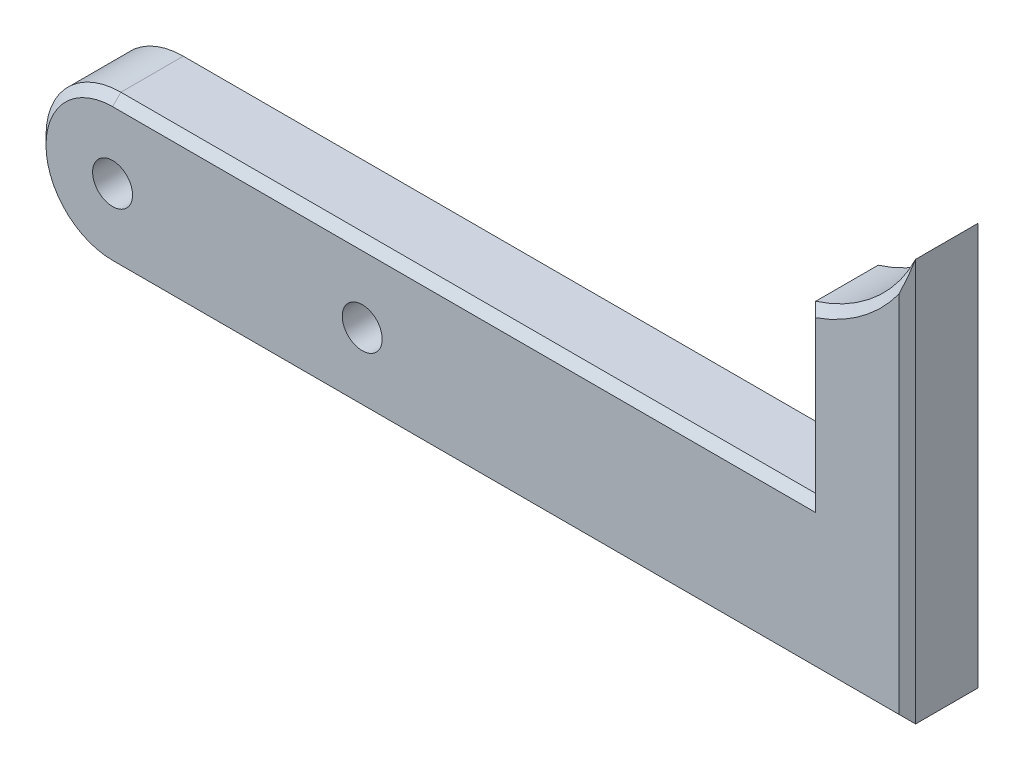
ISO-10303-21;
HEADER;
FILE_DESCRIPTION(('STEP AP214'),'2;1');
FILE_NAME('part.step','',(''),(''),'','','');
FILE_SCHEMA(('AUTOMOTIVE_DESIGN { 1 0 10303 214 1 1 1 1 }'));
ENDSEC;
DATA;
#1=APPLICATION_CONTEXT('core data for automotive mechanical design processes');
#2=APPLICATION_PROTOCOL_DEFINITION('international standard','automotive_design',2000,#1);
#3=PRODUCT_CONTEXT('',#1,'mechanical');
#4=PRODUCT('Part','Part','',(#3));
#5=PRODUCT_RELATED_PRODUCT_CATEGORY('part','',(#4));
#6=PRODUCT_DEFINITION_FORMATION('','',#4);
#7=PRODUCT_DEFINITION_CONTEXT('part definition',#1,'design');
#8=PRODUCT_DEFINITION('design','',#6,#7);
#9=PRODUCT_DEFINITION_SHAPE('','',#8);
#10=(LENGTH_UNIT() NAMED_UNIT(*) SI_UNIT(.MILLI.,.METRE.));
#11=(NAMED_UNIT(*) PLANE_ANGLE_UNIT() SI_UNIT($,.RADIAN.));
#12=(NAMED_UNIT(*) SI_UNIT($,.STERADIAN.) SOLID_ANGLE_UNIT());
#13=UNCERTAINTY_MEASURE_WITH_UNIT(LENGTH_MEASURE(1.E-05),#10,'distance_accuracy_value','');
#14=(GEOMETRIC_REPRESENTATION_CONTEXT(3) GLOBAL_UNCERTAINTY_ASSIGNED_CONTEXT((#13)) GLOBAL_UNIT_ASSIGNED_CONTEXT((#10,
#11,#12)) REPRESENTATION_CONTEXT('',''));
#15=CARTESIAN_POINT('',(0.,0.,0.));
#16=DIRECTION('',(0.,0.,1.));
#17=DIRECTION('',(1.,0.,0.));
#18=AXIS2_PLACEMENT_3D('',#15,#16,#17);
#19=CARTESIAN_POINT('',(96.5,67.0787840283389,4.75));
#20=DIRECTION('',(0.,0.,1.));
#21=DIRECTION('',(1.,0.,0.));
#22=AXIS2_PLACEMENT_3D('',#19,#20,#21);
#23=PLANE('',#22);
#24=CARTESIAN_POINT('',(19.,19.,4.75));
#25=DIRECTION('',(0.,0.,1.));
#26=DIRECTION('',(1.,0.,0.));
#27=AXIS2_PLACEMENT_3D('',#24,#25,#26);
#28=CIRCLE('',#27,8.00000000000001);
#29=CARTESIAN_POINT('',(11.,19.,4.75));
#30=VERTEX_POINT('',#29);
#31=CARTESIAN_POINT('',(19.,11.,4.75));
#32=VERTEX_POINT('',#31);
#33=EDGE_CURVE('E47',#30,#32,#28,.T.);
#34=ORIENTED_EDGE('',*,*,#33,.T.);
#35=DIRECTION('',(1.,0.,0.));
#36=VECTOR('',#35,1.);
#37=CARTESIAN_POINT('',(114.5,11.,4.75));
#38=LINE('',#37,#36);
#39=CARTESIAN_POINT('',(113.5,11.,4.75));
#40=VERTEX_POINT('',#39);
#41=EDGE_CURVE('E11',#32,#40,#38,.T.);
#42=ORIENTED_EDGE('',*,*,#41,.T.);
#43=DIRECTION('',(0.,1.,0.));
#44=VECTOR('',#43,1.);
#45=CARTESIAN_POINT('',(113.5,58.3609861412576,4.75));
#46=LINE('',#45,#44);
#47=CARTESIAN_POINT('',(113.5,54.749956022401,4.75));
#48=VERTEX_POINT('',#47);
#49=EDGE_CURVE('E227',#40,#48,#46,.T.);
#50=ORIENTED_EDGE('',*,*,#49,.T.);
#51=CARTESIAN_POINT('',(96.5,67.0787840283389,4.75));
#52=DIRECTION('',(0.,0.,1.));
#53=DIRECTION('',(1.,0.,0.));
#54=AXIS2_PLACEMENT_3D('',#51,#52,#53);
#55=CIRCLE('',#54,21.);
#56=CARTESIAN_POINT('',(103.5,47.2797941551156,4.75));
#57=VERTEX_POINT('',#56);
#58=EDGE_CURVE('E225',#48,#57,#55,.F.);
#59=ORIENTED_EDGE('',*,*,#58,.T.);
#60=DIRECTION('',(0.,-1.,0.));
#61=VECTOR('',#60,1.);
#62=CARTESIAN_POINT('',(103.5,28.,4.75));
#63=LINE('',#62,#61);
#64=CARTESIAN_POINT('',(103.5,27.,4.75));
#65=VERTEX_POINT('',#64);
#66=EDGE_CURVE('E223',#57,#65,#63,.T.);
#67=ORIENTED_EDGE('',*,*,#66,.T.);
#68=DIRECTION('',(-1.,0.,0.));
#69=VECTOR('',#68,1.);
#70=CARTESIAN_POINT('',(19.,27.,4.75));
#71=LINE('',#70,#69);
#72=CARTESIAN_POINT('',(19.,27.,4.75));
#73=VERTEX_POINT('',#72);
#74=EDGE_CURVE('E221',#65,#73,#71,.T.);
#75=ORIENTED_EDGE('',*,*,#74,.T.);
#76=CARTESIAN_POINT('',(19.,19.,4.75));
#77=DIRECTION('',(0.,0.,1.));
#78=DIRECTION('',(1.,0.,0.));
#79=AXIS2_PLACEMENT_3D('',#76,#77,#78);
#80=CIRCLE('',#79,8.00000000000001);
#81=EDGE_CURVE('E58',#73,#30,#80,.T.);
#82=ORIENTED_EDGE('',*,*,#81,.T.);
#83=EDGE_LOOP('',(#34,#42,#50,#59,#67,#75,#82));
#84=FACE_BOUND('',#83,.T.);
#85=CARTESIAN_POINT('',(19.,19.,4.75));
#86=DIRECTION('',(0.,0.,1.));
#87=DIRECTION('',(1.,0.,0.));
#88=AXIS2_PLACEMENT_3D('',#85,#86,#87);
#89=CIRCLE('',#88,2.4);
#90=CARTESIAN_POINT('',(21.4,19.,4.75));
#91=VERTEX_POINT('',#90);
#92=EDGE_CURVE('E366',#91,#91,#89,.T.);
#93=ORIENTED_EDGE('',*,*,#92,.F.);
#94=EDGE_LOOP('',(#93));
#95=FACE_BOUND('',#94,.T.);
#96=CARTESIAN_POINT('',(49.,19.,4.75));
#97=DIRECTION('',(0.,0.,1.));
#98=DIRECTION('',(1.,0.,0.));
#99=AXIS2_PLACEMENT_3D('',#96,#97,#98);
#100=CIRCLE('',#99,2.4);
#101=CARTESIAN_POINT('',(51.4,19.,4.75));
#102=VERTEX_POINT('',#101);
#103=EDGE_CURVE('E370',#102,#102,#100,.T.);
#104=ORIENTED_EDGE('',*,*,#103,.F.);
#105=EDGE_LOOP('',(#104));
#106=FACE_BOUND('',#105,.T.);
#107=ADVANCED_FACE('F37',(#84,#95,#106),#23,.T.);
#108=CARTESIAN_POINT('',(96.5,67.0787840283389,-4.75));
#109=DIRECTION('',(0.,0.,1.));
#110=DIRECTION('',(1.,0.,0.));
#111=AXIS2_PLACEMENT_3D('',#108,#109,#110);
#112=PLANE('',#111);
#113=DIRECTION('',(0.,-1.,0.));
#114=VECTOR('',#113,1.);
#115=CARTESIAN_POINT('',(113.5,67.0787840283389,-4.75));
#116=LINE('',#115,#114);
#117=CARTESIAN_POINT('',(113.5,54.749956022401,-4.75));
#118=VERTEX_POINT('',#117);
#119=CARTESIAN_POINT('',(113.5,11.,-4.75));
#120=VERTEX_POINT('',#119);
#121=EDGE_CURVE('E192',#118,#120,#116,.T.);
#122=ORIENTED_EDGE('',*,*,#121,.T.);
#123=DIRECTION('',(-1.,0.,0.));
#124=VECTOR('',#123,1.);
#125=CARTESIAN_POINT('',(96.5,11.,-4.75));
#126=LINE('',#125,#124);
#127=CARTESIAN_POINT('',(19.,11.,-4.75));
#128=VERTEX_POINT('',#127);
#129=EDGE_CURVE('E158',#120,#128,#126,.T.);
#130=ORIENTED_EDGE('',*,*,#129,.T.);
#131=CARTESIAN_POINT('',(19.,19.,-4.75));
#132=DIRECTION('',(0.,0.,1.));
#133=DIRECTION('',(1.,0.,0.));
#134=AXIS2_PLACEMENT_3D('',#131,#132,#133);
#135=CIRCLE('',#134,8.);
#136=CARTESIAN_POINT('',(11.,19.,-4.75));
#137=VERTEX_POINT('',#136);
#138=EDGE_CURVE('E196',#128,#137,#135,.F.);
#139=ORIENTED_EDGE('',*,*,#138,.T.);
#140=CARTESIAN_POINT('',(19.,19.,-4.75));
#141=DIRECTION('',(0.,0.,1.));
#142=DIRECTION('',(1.,0.,0.));
#143=AXIS2_PLACEMENT_3D('',#140,#141,#142);
#144=CIRCLE('',#143,8.);
#145=CARTESIAN_POINT('',(19.,27.,-4.75));
#146=VERTEX_POINT('',#145);
#147=EDGE_CURVE('E194',#137,#146,#144,.F.);
#148=ORIENTED_EDGE('',*,*,#147,.T.);
#149=DIRECTION('',(1.,0.,0.));
#150=VECTOR('',#149,1.);
#151=CARTESIAN_POINT('',(96.5,27.,-4.75));
#152=LINE('',#151,#150);
#153=CARTESIAN_POINT('',(103.5,27.,-4.75));
#154=VERTEX_POINT('',#153);
#155=EDGE_CURVE('E186',#146,#154,#152,.T.);
#156=ORIENTED_EDGE('',*,*,#155,.T.);
#157=DIRECTION('',(0.,1.,0.));
#158=VECTOR('',#157,1.);
#159=CARTESIAN_POINT('',(103.5,67.0787840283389,-4.75));
#160=LINE('',#159,#158);
#161=CARTESIAN_POINT('',(103.5,47.2797941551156,-4.75));
#162=VERTEX_POINT('',#161);
#163=EDGE_CURVE('E188',#154,#162,#160,.T.);
#164=ORIENTED_EDGE('',*,*,#163,.T.);
#165=CARTESIAN_POINT('',(96.5,67.0787840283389,-4.75));
#166=DIRECTION('',(0.,0.,1.));
#167=DIRECTION('',(1.,0.,0.));
#168=AXIS2_PLACEMENT_3D('',#165,#166,#167);
#169=CIRCLE('',#168,21.);
#170=EDGE_CURVE('E190',#162,#118,#169,.T.);
#171=ORIENTED_EDGE('',*,*,#170,.T.);
#172=EDGE_LOOP('',(#122,#130,#139,#148,#156,#164,#171));
#173=FACE_BOUND('',#172,.T.);
#174=CARTESIAN_POINT('',(19.,19.,-4.75));
#175=DIRECTION('',(0.,0.,1.));
#176=DIRECTION('',(1.,0.,0.));
#177=AXIS2_PLACEMENT_3D('',#174,#175,#176);
#178=CIRCLE('',#177,2.4);
#179=CARTESIAN_POINT('',(21.4,19.,-4.75));
#180=VERTEX_POINT('',#179);
#181=EDGE_CURVE('E367',#180,#180,#178,.T.);
#182=ORIENTED_EDGE('',*,*,#181,.T.);
#183=EDGE_LOOP('',(#182));
#184=FACE_BOUND('',#183,.T.);
#185=CARTESIAN_POINT('',(49.,19.,-4.75));
#186=DIRECTION('',(0.,0.,1.));
#187=DIRECTION('',(1.,0.,0.));
#188=AXIS2_PLACEMENT_3D('',#185,#186,#187);
#189=CIRCLE('',#188,2.4);
#190=CARTESIAN_POINT('',(51.4,19.,-4.75));
#191=VERTEX_POINT('',#190);
#192=EDGE_CURVE('E182',#191,#191,#189,.T.);
#193=ORIENTED_EDGE('',*,*,#192,.T.);
#194=EDGE_LOOP('',(#193));
#195=FACE_BOUND('',#194,.T.);
#196=ADVANCED_FACE('F382',(#173,#184,#195),#112,.F.);
#197=CARTESIAN_POINT('',(10.,10.,4.75));
#198=DIRECTION('',(0.,1.,0.));
#199=DIRECTION('',(-1.,0.,0.));
#200=AXIS2_PLACEMENT_3D('',#197,#198,#199);
#201=PLANE('',#200);
#202=DIRECTION('',(0.,0.,-1.));
#203=VECTOR('',#202,1.);
#204=CARTESIAN_POINT('',(19.,10.,4.75));
#205=LINE('',#204,#203);
#206=CARTESIAN_POINT('',(19.,10.,3.75));
#207=VERTEX_POINT('',#206);
#208=CARTESIAN_POINT('',(19.,10.,-3.75));
#209=VERTEX_POINT('',#208);
#210=EDGE_CURVE('E165',#207,#209,#205,.T.);
#211=ORIENTED_EDGE('',*,*,#210,.T.);
#212=DIRECTION('',(1.,0.,0.));
#213=VECTOR('',#212,1.);
#214=CARTESIAN_POINT('',(10.,10.,-3.75));
#215=LINE('',#214,#213);
#216=CARTESIAN_POINT('',(114.5,10.,-3.75));
#217=VERTEX_POINT('',#216);
#218=EDGE_CURVE('E169',#209,#217,#215,.T.);
#219=ORIENTED_EDGE('',*,*,#218,.T.);
#220=DIRECTION('',(0.,0.,-1.));
#221=VECTOR('',#220,1.);
#222=CARTESIAN_POINT('',(114.5,10.,4.75));
#223=LINE('',#222,#221);
#224=CARTESIAN_POINT('',(114.5,10.,3.75));
#225=VERTEX_POINT('',#224);
#226=EDGE_CURVE('E168',#225,#217,#223,.T.);
#227=ORIENTED_EDGE('',*,*,#226,.F.);
#228=DIRECTION('',(-1.,0.,0.));
#229=VECTOR('',#228,1.);
#230=CARTESIAN_POINT('',(19.,10.,3.75));
#231=LINE('',#230,#229);
#232=EDGE_CURVE('E143',#225,#207,#231,.T.);
#233=ORIENTED_EDGE('',*,*,#232,.T.);
#234=EDGE_LOOP('',(#211,#219,#227,#233));
#235=FACE_BOUND('',#234,.T.);
#236=ADVANCED_FACE('F163',(#235),#201,.F.);
#237=CARTESIAN_POINT('',(114.5,58.3609861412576,4.75));
#238=DIRECTION('',(-1.,0.,0.));
#239=DIRECTION('',(0.,0.,1.));
#240=AXIS2_PLACEMENT_3D('',#237,#238,#239);
#241=PLANE('',#240);
#242=ORIENTED_EDGE('',*,*,#226,.T.);
#243=DIRECTION('',(0.,1.,0.));
#244=VECTOR('',#243,1.);
#245=CARTESIAN_POINT('',(114.5,58.3609861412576,-3.75));
#246=LINE('',#245,#244);
#247=CARTESIAN_POINT('',(114.5,58.3609861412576,-3.75));
#248=VERTEX_POINT('',#247);
#249=EDGE_CURVE('E207',#217,#248,#246,.T.);
#250=ORIENTED_EDGE('',*,*,#249,.T.);
#251=DIRECTION('',(0.,0.,-1.));
#252=VECTOR('',#251,1.);
#253=CARTESIAN_POINT('',(114.5,58.3609861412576,4.75));
#254=LINE('',#253,#252);
#255=CARTESIAN_POINT('',(114.5,58.3609861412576,3.75));
#256=VERTEX_POINT('',#255);
#257=EDGE_CURVE('E177',#256,#248,#254,.T.);
#258=ORIENTED_EDGE('',*,*,#257,.F.);
#259=DIRECTION('',(0.,-1.,0.));
#260=VECTOR('',#259,1.);
#261=CARTESIAN_POINT('',(114.5,10.,3.75));
#262=LINE('',#261,#260);
#263=EDGE_CURVE('E205',#256,#225,#262,.T.);
#264=ORIENTED_EDGE('',*,*,#263,.T.);
#265=EDGE_LOOP('',(#242,#250,#258,#264));
#266=FACE_BOUND('',#265,.T.);
#267=ADVANCED_FACE('F354',(#266),#241,.F.);
#268=CARTESIAN_POINT('',(96.5,67.0787840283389,4.75));
#269=DIRECTION('',(0.,0.,-1.));
#270=DIRECTION('',(-1.,0.,0.));
#271=AXIS2_PLACEMENT_3D('',#268,#269,#270);
#272=CYLINDRICAL_SURFACE('',#271,20.);
#273=ORIENTED_EDGE('',*,*,#257,.T.);
#274=CARTESIAN_POINT('',(96.5,67.0787840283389,-3.75));
#275=DIRECTION('',(0.,0.,1.));
#276=DIRECTION('',(1.,0.,0.));
#277=AXIS2_PLACEMENT_3D('',#274,#275,#276);
#278=CIRCLE('',#277,20.);
#279=CARTESIAN_POINT('',(102.5,48.,-3.75));
#280=VERTEX_POINT('',#279);
#281=EDGE_CURVE('E211',#248,#280,#278,.F.);
#282=ORIENTED_EDGE('',*,*,#281,.T.);
#283=DIRECTION('',(0.,0.,-1.));
#284=VECTOR('',#283,1.);
#285=CARTESIAN_POINT('',(102.5,48.,4.75));
#286=LINE('',#285,#284);
#287=CARTESIAN_POINT('',(102.5,48.,3.75));
#288=VERTEX_POINT('',#287);
#289=EDGE_CURVE('E359',#288,#280,#286,.T.);
#290=ORIENTED_EDGE('',*,*,#289,.F.);
#291=CARTESIAN_POINT('',(96.5,67.0787840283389,3.75));
#292=DIRECTION('',(0.,0.,1.));
#293=DIRECTION('',(1.,0.,0.));
#294=AXIS2_PLACEMENT_3D('',#291,#292,#293);
#295=CIRCLE('',#294,20.);
#296=EDGE_CURVE('E209',#288,#256,#295,.T.);
#297=ORIENTED_EDGE('',*,*,#296,.T.);
#298=EDGE_LOOP('',(#273,#282,#290,#297));
#299=FACE_BOUND('',#298,.T.);
#300=ADVANCED_FACE('F400',(#299),#272,.F.);
#301=CARTESIAN_POINT('',(102.5,48.,4.75));
#302=DIRECTION('',(1.,0.,0.));
#303=DIRECTION('',(0.,0.,-1.));
#304=AXIS2_PLACEMENT_3D('',#301,#302,#303);
#305=PLANE('',#304);
#306=ORIENTED_EDGE('',*,*,#289,.T.);
#307=DIRECTION('',(0.,-1.,0.));
#308=VECTOR('',#307,1.);
#309=CARTESIAN_POINT('',(102.5,48.,-3.75));
#310=LINE('',#309,#308);
#311=CARTESIAN_POINT('',(102.5,28.,-3.75));
#312=VERTEX_POINT('',#311);
#313=EDGE_CURVE('E215',#280,#312,#310,.T.);
#314=ORIENTED_EDGE('',*,*,#313,.T.);
#315=DIRECTION('',(0.,0.,-1.));
#316=VECTOR('',#315,1.);
#317=CARTESIAN_POINT('',(102.5,28.,4.75));
#318=LINE('',#317,#316);
#319=CARTESIAN_POINT('',(102.5,28.,3.75));
#320=VERTEX_POINT('',#319);
#321=EDGE_CURVE('E361',#320,#312,#318,.T.);
#322=ORIENTED_EDGE('',*,*,#321,.F.);
#323=DIRECTION('',(0.,1.,0.));
#324=VECTOR('',#323,1.);
#325=CARTESIAN_POINT('',(102.5,48.,3.75));
#326=LINE('',#325,#324);
#327=EDGE_CURVE('E213',#320,#288,#326,.T.);
#328=ORIENTED_EDGE('',*,*,#327,.T.);
#329=EDGE_LOOP('',(#306,#314,#322,#328));
#330=FACE_BOUND('',#329,.T.);
#331=ADVANCED_FACE('F396',(#330),#305,.F.);
#332=CARTESIAN_POINT('',(10.,28.,4.75));
#333=DIRECTION('',(0.,-1.,0.));
#334=DIRECTION('',(1.,0.,0.));
#335=AXIS2_PLACEMENT_3D('',#332,#333,#334);
#336=PLANE('',#335);
#337=ORIENTED_EDGE('',*,*,#321,.T.);
#338=DIRECTION('',(-1.,0.,0.));
#339=VECTOR('',#338,1.);
#340=CARTESIAN_POINT('',(10.,28.,-3.75));
#341=LINE('',#340,#339);
#342=CARTESIAN_POINT('',(19.,28.,-3.75));
#343=VERTEX_POINT('',#342);
#344=EDGE_CURVE('E219',#312,#343,#341,.T.);
#345=ORIENTED_EDGE('',*,*,#344,.T.);
#346=DIRECTION('',(0.,0.,-1.));
#347=VECTOR('',#346,1.);
#348=CARTESIAN_POINT('',(19.,28.,4.75));
#349=LINE('',#348,#347);
#350=CARTESIAN_POINT('',(19.,28.,3.75));
#351=VERTEX_POINT('',#350);
#352=EDGE_CURVE('E170',#343,#351,#349,.F.);
#353=ORIENTED_EDGE('',*,*,#352,.T.);
#354=DIRECTION('',(1.,0.,0.));
#355=VECTOR('',#354,1.);
#356=CARTESIAN_POINT('',(102.5,28.,3.75));
#357=LINE('',#356,#355);
#358=EDGE_CURVE('E217',#351,#320,#357,.T.);
#359=ORIENTED_EDGE('',*,*,#358,.T.);
#360=EDGE_LOOP('',(#337,#345,#353,#359));
#361=FACE_BOUND('',#360,.T.);
#362=ADVANCED_FACE('F393',(#361),#336,.F.);
#363=CARTESIAN_POINT('',(19.,19.,4.75));
#364=DIRECTION('',(0.,0.,-1.));
#365=DIRECTION('',(-1.,0.,0.));
#366=AXIS2_PLACEMENT_3D('',#363,#364,#365);
#367=CYLINDRICAL_SURFACE('',#366,2.4);
#368=ORIENTED_EDGE('',*,*,#92,.T.);
#369=EDGE_LOOP('',(#368));
#370=FACE_BOUND('',#369,.T.);
#371=ORIENTED_EDGE('',*,*,#181,.F.);
#372=EDGE_LOOP('',(#371));
#373=FACE_BOUND('',#372,.T.);
#374=ADVANCED_FACE('F390',(#370,#373),#367,.F.);
#375=CARTESIAN_POINT('',(49.,19.,4.75));
#376=DIRECTION('',(0.,0.,-1.));
#377=DIRECTION('',(-1.,0.,0.));
#378=AXIS2_PLACEMENT_3D('',#375,#376,#377);
#379=CYLINDRICAL_SURFACE('',#378,2.4);
#380=ORIENTED_EDGE('',*,*,#103,.T.);
#381=EDGE_LOOP('',(#380));
#382=FACE_BOUND('',#381,.T.);
#383=ORIENTED_EDGE('',*,*,#192,.F.);
#384=EDGE_LOOP('',(#383));
#385=FACE_BOUND('',#384,.T.);
#386=ADVANCED_FACE('F378',(#382,#385),#379,.F.);
#387=CARTESIAN_POINT('',(19.,19.,4.75));
#388=DIRECTION('',(0.,0.,-1.));
#389=DIRECTION('',(-1.,0.,0.));
#390=AXIS2_PLACEMENT_3D('',#387,#388,#389);
#391=CYLINDRICAL_SURFACE('',#390,9.);
#392=ORIENTED_EDGE('',*,*,#352,.F.);
#393=CARTESIAN_POINT('',(19.,19.,-3.75));
#394=DIRECTION('',(0.,0.,1.));
#395=DIRECTION('',(1.,0.,0.));
#396=AXIS2_PLACEMENT_3D('',#393,#394,#395);
#397=CIRCLE('',#396,9.);
#398=CARTESIAN_POINT('',(10.,19.,-3.75));
#399=VERTEX_POINT('',#398);
#400=EDGE_CURVE('E203',#343,#399,#397,.T.);
#401=ORIENTED_EDGE('',*,*,#400,.T.);
#402=DIRECTION('',(0.,0.,-1.));
#403=VECTOR('',#402,1.);
#404=CARTESIAN_POINT('',(10.,19.,4.75));
#405=LINE('',#404,#403);
#406=CARTESIAN_POINT('',(10.,19.,3.75));
#407=VERTEX_POINT('',#406);
#408=EDGE_CURVE('E181',#407,#399,#405,.T.);
#409=ORIENTED_EDGE('',*,*,#408,.F.);
#410=CARTESIAN_POINT('',(19.,19.,3.75));
#411=DIRECTION('',(0.,0.,1.));
#412=DIRECTION('',(1.,0.,0.));
#413=AXIS2_PLACEMENT_3D('',#410,#411,#412);
#414=CIRCLE('',#413,9.);
#415=EDGE_CURVE('E201',#407,#351,#414,.F.);
#416=ORIENTED_EDGE('',*,*,#415,.T.);
#417=EDGE_LOOP('',(#392,#401,#409,#416));
#418=FACE_BOUND('',#417,.T.);
#419=ADVANCED_FACE('F410',(#418),#391,.T.);
#420=CARTESIAN_POINT('',(19.,19.,4.75));
#421=DIRECTION('',(0.,0.,-1.));
#422=DIRECTION('',(-1.,0.,0.));
#423=AXIS2_PLACEMENT_3D('',#420,#421,#422);
#424=CYLINDRICAL_SURFACE('',#423,9.);
#425=ORIENTED_EDGE('',*,*,#408,.T.);
#426=CARTESIAN_POINT('',(19.,19.,-3.75));
#427=DIRECTION('',(0.,0.,1.));
#428=DIRECTION('',(1.,0.,0.));
#429=AXIS2_PLACEMENT_3D('',#426,#427,#428);
#430=CIRCLE('',#429,9.);
#431=EDGE_CURVE('E157',#399,#209,#430,.T.);
#432=ORIENTED_EDGE('',*,*,#431,.T.);
#433=ORIENTED_EDGE('',*,*,#210,.F.);
#434=CARTESIAN_POINT('',(19.,19.,3.75));
#435=DIRECTION('',(0.,0.,1.));
#436=DIRECTION('',(1.,0.,0.));
#437=AXIS2_PLACEMENT_3D('',#434,#435,#436);
#438=CIRCLE('',#437,9.);
#439=EDGE_CURVE('E150',#207,#407,#438,.F.);
#440=ORIENTED_EDGE('',*,*,#439,.T.);
#441=EDGE_LOOP('',(#425,#432,#433,#440));
#442=FACE_BOUND('',#441,.T.);
#443=ADVANCED_FACE('F172',(#442),#424,.T.);
#444=CARTESIAN_POINT('',(10.,28.,-3.75));
#445=DIRECTION('',(0.,-0.707106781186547,0.707106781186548));
#446=DIRECTION('',(-1.,0.,0.));
#447=AXIS2_PLACEMENT_3D('',#444,#445,#446);
#448=PLANE('',#447);
#449=DIRECTION('',(0.,-0.707106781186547,-0.707106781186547));
#450=VECTOR('',#449,1.);
#451=CARTESIAN_POINT('',(19.,28.,-3.75));
#452=LINE('',#451,#450);
#453=EDGE_CURVE('E285',#343,#146,#452,.T.);
#454=ORIENTED_EDGE('',*,*,#453,.F.);
#455=ORIENTED_EDGE('',*,*,#344,.F.);
#456=DIRECTION('',(0.577350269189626,-0.577350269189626,-0.577350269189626));
#457=VECTOR('',#456,1.);
#458=CARTESIAN_POINT('',(95.8333333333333,34.6666666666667,2.91666666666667));
#459=LINE('',#458,#457);
#460=EDGE_CURVE('E183',#154,#312,#459,.F.);
#461=ORIENTED_EDGE('',*,*,#460,.F.);
#462=ORIENTED_EDGE('',*,*,#155,.F.);
#463=EDGE_LOOP('',(#454,#455,#461,#462));
#464=FACE_BOUND('',#463,.T.);
#465=ADVANCED_FACE('F275',(#464),#448,.F.);
#466=CARTESIAN_POINT('',(102.5,48.,-3.75));
#467=DIRECTION('',(0.707106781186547,0.,0.707106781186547));
#468=DIRECTION('',(0.,-1.,0.));
#469=AXIS2_PLACEMENT_3D('',#466,#467,#468);
#470=PLANE('',#469);
#471=ORIENTED_EDGE('',*,*,#460,.T.);
#472=ORIENTED_EDGE('',*,*,#313,.F.);
#473=CARTESIAN_POINT('',(102.5,48.,-3.75));
#474=CARTESIAN_POINT('',(102.666030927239,47.8782000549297,-3.91603092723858));
#475=CARTESIAN_POINT('',(102.832379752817,47.757282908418,-4.08237975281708));
#476=CARTESIAN_POINT('',(103.165713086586,47.5172142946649,-4.41571308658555));
#477=CARTESIAN_POINT('',(103.33269759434,47.3980628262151,-4.58269759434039));
#478=CARTESIAN_POINT('',(103.5,47.2797941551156,-4.74999999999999));
#479=B_SPLINE_CURVE_WITH_KNOTS('',3,(#473,#474,#475,#476,#477,#478),.UNSPECIFIED.,.F.,.F.,(4,2,
4),(0.,0.79352591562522,1.58705128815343),.UNSPECIFIED.);
#480=EDGE_CURVE('E278',#162,#280,#479,.F.);
#481=ORIENTED_EDGE('',*,*,#480,.F.);
#482=ORIENTED_EDGE('',*,*,#163,.F.);
#483=EDGE_LOOP('',(#471,#472,#481,#482));
#484=FACE_BOUND('',#483,.T.);
#485=ADVANCED_FACE('F267',(#484),#470,.F.);
#486=CARTESIAN_POINT('',(19.,19.,-4.75));
#487=DIRECTION('',(0.,0.,1.));
#488=DIRECTION('',(1.,0.,0.));
#489=AXIS2_PLACEMENT_3D('',#486,#487,#488);
#490=CONICAL_SURFACE('',#489,8.,0.785398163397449);
#491=ORIENTED_EDGE('',*,*,#453,.T.);
#492=ORIENTED_EDGE('',*,*,#147,.F.);
#493=DIRECTION('',(0.707106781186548,0.,-0.707106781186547));
#494=VECTOR('',#493,1.);
#495=CARTESIAN_POINT('',(10.,19.,-3.75));
#496=LINE('',#495,#494);
#497=EDGE_CURVE('E244',#399,#137,#496,.T.);
#498=ORIENTED_EDGE('',*,*,#497,.F.);
#499=ORIENTED_EDGE('',*,*,#400,.F.);
#500=EDGE_LOOP('',(#491,#492,#498,#499));
#501=FACE_BOUND('',#500,.T.);
#502=ADVANCED_FACE('F274',(#501),#490,.T.);
#503=CARTESIAN_POINT('',(96.5,67.0787840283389,-3.75));
#504=DIRECTION('',(0.,0.,-1.));
#505=DIRECTION('',(-1.,0.,0.));
#506=AXIS2_PLACEMENT_3D('',#503,#504,#505);
#507=CONICAL_SURFACE('',#506,20.,0.78539816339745);
#508=ORIENTED_EDGE('',*,*,#480,.T.);
#509=ORIENTED_EDGE('',*,*,#281,.F.);
#510=CARTESIAN_POINT('',(114.5,58.3609861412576,-3.75));
#511=CARTESIAN_POINT('',(114.429406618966,58.0532667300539,-3.8205933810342));
#512=CARTESIAN_POINT('',(114.355429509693,57.7471104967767,-3.89457049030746));
#513=CARTESIAN_POINT('',(114.201054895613,57.1383437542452,-4.04894510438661));
#514=CARTESIAN_POINT('',(114.120662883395,56.8357304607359,-4.12933711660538));
#515=CARTESIAN_POINT('',(113.953689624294,56.233963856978,-4.29631037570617));
#516=CARTESIAN_POINT('',(113.867108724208,55.9348103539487,-4.38289127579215));
#517=CARTESIAN_POINT('',(113.687961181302,55.3398082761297,-4.56203881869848));
#518=CARTESIAN_POINT('',(113.595389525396,55.0439627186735,-4.65461047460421));
#519=CARTESIAN_POINT('',(113.5,54.749956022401,-4.75));
#520=B_SPLINE_CURVE_WITH_KNOTS('',3,(#510,#511,#512,#513,#514,#515,#516,#517,#518,#519),
.UNSPECIFIED.,.F.,.F.,(4,2,2,2,4),(0.,0.970473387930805,1.94012457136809,2.90972146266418,
3.88014047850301),.UNSPECIFIED.);
#521=EDGE_CURVE('E235',#118,#248,#520,.F.);
#522=ORIENTED_EDGE('',*,*,#521,.F.);
#523=ORIENTED_EDGE('',*,*,#170,.F.);
#524=EDGE_LOOP('',(#508,#509,#522,#523));
#525=FACE_BOUND('',#524,.T.);
#526=ADVANCED_FACE('F247',(#525),#507,.F.);
#527=CARTESIAN_POINT('',(19.,19.,-4.75));
#528=DIRECTION('',(0.,0.,1.));
#529=DIRECTION('',(1.,0.,0.));
#530=AXIS2_PLACEMENT_3D('',#527,#528,#529);
#531=CONICAL_SURFACE('',#530,8.,0.785398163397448);
#532=ORIENTED_EDGE('',*,*,#497,.T.);
#533=ORIENTED_EDGE('',*,*,#138,.F.);
#534=DIRECTION('',(0.,0.707106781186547,-0.707106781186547));
#535=VECTOR('',#534,1.);
#536=CARTESIAN_POINT('',(19.,10.,-3.75));
#537=LINE('',#536,#535);
#538=EDGE_CURVE('E233',#209,#128,#537,.T.);
#539=ORIENTED_EDGE('',*,*,#538,.F.);
#540=ORIENTED_EDGE('',*,*,#431,.F.);
#541=EDGE_LOOP('',(#532,#533,#539,#540));
#542=FACE_BOUND('',#541,.T.);
#543=ADVANCED_FACE('F259',(#542),#531,.T.);
#544=CARTESIAN_POINT('',(114.5,58.3609861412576,-3.75));
#545=DIRECTION('',(-0.707106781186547,0.,0.707106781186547));
#546=DIRECTION('',(0.,1.,0.));
#547=AXIS2_PLACEMENT_3D('',#544,#545,#546);
#548=PLANE('',#547);
#549=ORIENTED_EDGE('',*,*,#521,.T.);
#550=ORIENTED_EDGE('',*,*,#249,.F.);
#551=DIRECTION('',(-0.577350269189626,0.577350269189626,-0.577350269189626));
#552=VECTOR('',#551,1.);
#553=CARTESIAN_POINT('',(98.3796712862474,26.1203287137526,-19.8703287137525));
#554=LINE('',#553,#552);
#555=EDGE_CURVE('E231',#120,#217,#554,.F.);
#556=ORIENTED_EDGE('',*,*,#555,.F.);
#557=ORIENTED_EDGE('',*,*,#121,.F.);
#558=EDGE_LOOP('',(#549,#550,#556,#557));
#559=FACE_BOUND('',#558,.T.);
#560=ADVANCED_FACE('F251',(#559),#548,.F.);
#561=CARTESIAN_POINT('',(10.,10.,-3.75));
#562=DIRECTION('',(0.,0.707106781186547,0.707106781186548));
#563=DIRECTION('',(1.,0.,0.));
#564=AXIS2_PLACEMENT_3D('',#561,#562,#563);
#565=PLANE('',#564);
#566=ORIENTED_EDGE('',*,*,#538,.T.);
#567=ORIENTED_EDGE('',*,*,#129,.F.);
#568=ORIENTED_EDGE('',*,*,#555,.T.);
#569=ORIENTED_EDGE('',*,*,#218,.F.);
#570=EDGE_LOOP('',(#566,#567,#568,#569));
#571=FACE_BOUND('',#570,.T.);
#572=ADVANCED_FACE('F258',(#571),#565,.F.);
#573=CARTESIAN_POINT('',(96.5,27.,4.75));
#574=DIRECTION('',(0.,0.707106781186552,0.707106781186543));
#575=DIRECTION('',(1.,0.,0.));
#576=AXIS2_PLACEMENT_3D('',#573,#574,#575);
#577=PLANE('',#576);
#578=DIRECTION('',(0.,0.707106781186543,-0.707106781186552));
#579=VECTOR('',#578,1.);
#580=CARTESIAN_POINT('',(19.,27.,4.75));
#581=LINE('',#580,#579);
#582=EDGE_CURVE('E332',#73,#351,#581,.T.);
#583=ORIENTED_EDGE('',*,*,#582,.F.);
#584=ORIENTED_EDGE('',*,*,#74,.F.);
#585=DIRECTION('',(-0.577350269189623,0.577350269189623,-0.577350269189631));
#586=VECTOR('',#585,1.);
#587=CARTESIAN_POINT('',(90.1404053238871,40.3595946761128,-8.60959467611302));
#588=LINE('',#587,#586);
#589=EDGE_CURVE('E42',#320,#65,#588,.F.);
#590=ORIENTED_EDGE('',*,*,#589,.F.);
#591=ORIENTED_EDGE('',*,*,#358,.F.);
#592=EDGE_LOOP('',(#583,#584,#590,#591));
#593=FACE_BOUND('',#592,.T.);
#594=ADVANCED_FACE('F40',(#593),#577,.T.);
#595=CARTESIAN_POINT('',(103.5,67.0787840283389,4.75));
#596=DIRECTION('',(-0.707106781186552,0.,0.707106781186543));
#597=DIRECTION('',(0.,1.,0.));
#598=AXIS2_PLACEMENT_3D('',#595,#596,#597);
#599=PLANE('',#598);
#600=ORIENTED_EDGE('',*,*,#589,.T.);
#601=ORIENTED_EDGE('',*,*,#66,.F.);
#602=CARTESIAN_POINT('',(103.5,47.2797941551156,4.75));
#603=CARTESIAN_POINT('',(103.33269759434,47.3980628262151,4.58269759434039));
#604=CARTESIAN_POINT('',(103.165713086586,47.517214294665,4.41571308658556));
#605=CARTESIAN_POINT('',(102.832379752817,47.757282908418,4.08237975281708));
#606=CARTESIAN_POINT('',(102.666030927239,47.8782000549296,3.91603092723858));
#607=CARTESIAN_POINT('',(102.5,48.,3.75));
#608=B_SPLINE_CURVE_WITH_KNOTS('',3,(#602,#603,#604,#605,#606,#607),.UNSPECIFIED.,.F.,.F.,(4,2,
4),(0.,0.793525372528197,1.58705128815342),.UNSPECIFIED.);
#609=EDGE_CURVE('E326',#288,#57,#608,.F.);
#610=ORIENTED_EDGE('',*,*,#609,.F.);
#611=ORIENTED_EDGE('',*,*,#327,.F.);
#612=EDGE_LOOP('',(#600,#601,#610,#611));
#613=FACE_BOUND('',#612,.T.);
#614=ADVANCED_FACE('F318',(#613),#599,.T.);
#615=CARTESIAN_POINT('',(19.,19.,4.75));
#616=DIRECTION('',(0.,0.,-1.));
#617=DIRECTION('',(-1.,0.,0.));
#618=AXIS2_PLACEMENT_3D('',#615,#616,#617);
#619=CONICAL_SURFACE('',#618,8.00000000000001,0.785398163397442);
#620=ORIENTED_EDGE('',*,*,#582,.T.);
#621=ORIENTED_EDGE('',*,*,#415,.F.);
#622=DIRECTION('',(-0.707106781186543,0.,-0.707106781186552));
#623=VECTOR('',#622,1.);
#624=CARTESIAN_POINT('',(11.,19.,4.75));
#625=LINE('',#624,#623);
#626=EDGE_CURVE('E152',#30,#407,#625,.T.);
#627=ORIENTED_EDGE('',*,*,#626,.F.);
#628=ORIENTED_EDGE('',*,*,#81,.F.);
#629=EDGE_LOOP('',(#620,#621,#627,#628));
#630=FACE_BOUND('',#629,.T.);
#631=ADVANCED_FACE('F324',(#630),#619,.T.);
#632=CARTESIAN_POINT('',(96.5,67.0787840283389,4.75));
#633=DIRECTION('',(0.,0.,1.));
#634=DIRECTION('',(1.,0.,0.));
#635=AXIS2_PLACEMENT_3D('',#632,#633,#634);
#636=CONICAL_SURFACE('',#635,21.,0.785398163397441);
#637=ORIENTED_EDGE('',*,*,#609,.T.);
#638=ORIENTED_EDGE('',*,*,#58,.F.);
#639=CARTESIAN_POINT('',(113.5,54.749956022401,4.75));
#640=CARTESIAN_POINT('',(113.595389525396,55.0439627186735,4.65461047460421));
#641=CARTESIAN_POINT('',(113.687961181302,55.3398082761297,4.56203881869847));
#642=CARTESIAN_POINT('',(113.867108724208,55.9348103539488,4.38289127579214));
#643=CARTESIAN_POINT('',(113.953689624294,56.233963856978,4.29631037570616));
#644=CARTESIAN_POINT('',(114.120662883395,56.835730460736,4.12933711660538));
#645=CARTESIAN_POINT('',(114.201054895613,57.1383437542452,4.04894510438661));
#646=CARTESIAN_POINT('',(114.355429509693,57.7471104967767,3.89457049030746));
#647=CARTESIAN_POINT('',(114.429406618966,58.0532667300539,3.82059338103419));
#648=CARTESIAN_POINT('',(114.5,58.3609861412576,3.75));
#649=B_SPLINE_CURVE_WITH_KNOTS('',3,(#639,#640,#641,#642,#643,#644,#645,#646,#647,#648),
.UNSPECIFIED.,.F.,.F.,(4,2,2,2,4),(0.,0.970419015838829,1.9400159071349,2.90966709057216,
3.88014047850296),.UNSPECIFIED.);
#650=EDGE_CURVE('E146',#256,#48,#649,.F.);
#651=ORIENTED_EDGE('',*,*,#650,.F.);
#652=ORIENTED_EDGE('',*,*,#296,.F.);
#653=EDGE_LOOP('',(#637,#638,#651,#652));
#654=FACE_BOUND('',#653,.T.);
#655=ADVANCED_FACE('F301',(#654),#636,.F.);
#656=CARTESIAN_POINT('',(19.,19.,4.75));
#657=DIRECTION('',(0.,0.,-1.));
#658=DIRECTION('',(-1.,0.,0.));
#659=AXIS2_PLACEMENT_3D('',#656,#657,#658);
#660=CONICAL_SURFACE('',#659,8.00000000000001,0.785398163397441);
#661=ORIENTED_EDGE('',*,*,#626,.T.);
#662=ORIENTED_EDGE('',*,*,#439,.F.);
#663=DIRECTION('',(0.,-0.707106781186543,-0.707106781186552));
#664=VECTOR('',#663,1.);
#665=CARTESIAN_POINT('',(19.,11.,4.75));
#666=LINE('',#665,#664);
#667=EDGE_CURVE('E139',#32,#207,#666,.T.);
#668=ORIENTED_EDGE('',*,*,#667,.F.);
#669=ORIENTED_EDGE('',*,*,#33,.F.);
#670=EDGE_LOOP('',(#661,#662,#668,#669));
#671=FACE_BOUND('',#670,.T.);
#672=ADVANCED_FACE('F151',(#671),#660,.T.);
#673=CARTESIAN_POINT('',(113.5,67.0787840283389,4.75));
#674=DIRECTION('',(0.707106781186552,0.,0.707106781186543));
#675=DIRECTION('',(0.,-1.,0.));
#676=AXIS2_PLACEMENT_3D('',#673,#674,#675);
#677=PLANE('',#676);
#678=ORIENTED_EDGE('',*,*,#650,.T.);
#679=ORIENTED_EDGE('',*,*,#49,.F.);
#680=DIRECTION('',(0.577350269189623,-0.577350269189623,-0.577350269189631));
#681=VECTOR('',#680,1.);
#682=CARTESIAN_POINT('',(94.8070719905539,29.6929280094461,23.4429280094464));
#683=LINE('',#682,#681);
#684=EDGE_CURVE('E147',#225,#40,#683,.F.);
#685=ORIENTED_EDGE('',*,*,#684,.F.);
#686=ORIENTED_EDGE('',*,*,#263,.F.);
#687=EDGE_LOOP('',(#678,#679,#685,#686));
#688=FACE_BOUND('',#687,.T.);
#689=ADVANCED_FACE('F305',(#688),#677,.T.);
#690=CARTESIAN_POINT('',(96.5,11.,4.75));
#691=DIRECTION('',(0.,-0.707106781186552,0.707106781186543));
#692=DIRECTION('',(-1.,0.,0.));
#693=AXIS2_PLACEMENT_3D('',#690,#691,#692);
#694=PLANE('',#693);
#695=ORIENTED_EDGE('',*,*,#667,.T.);
#696=ORIENTED_EDGE('',*,*,#232,.F.);
#697=ORIENTED_EDGE('',*,*,#684,.T.);
#698=ORIENTED_EDGE('',*,*,#41,.F.);
#699=EDGE_LOOP('',(#695,#696,#697,#698));
#700=FACE_BOUND('',#699,.T.);
#701=ADVANCED_FACE('F141',(#700),#694,.T.);
#702=CLOSED_SHELL('',(#107,#196,#236,#267,#300,#331,#362,#374,#386,#419,#443,#465,#485,#502,
#526,#543,#560,#572,#594,#614,#631,#655,#672,#689,#701));
#703=MANIFOLD_SOLID_BREP('B2',#702);
#704=ADVANCED_BREP_SHAPE_REPRESENTATION('',(#18,#703),#14);
#705=SHAPE_DEFINITION_REPRESENTATION(#9,#704);
ENDSEC;
END-ISO-10303-21;
